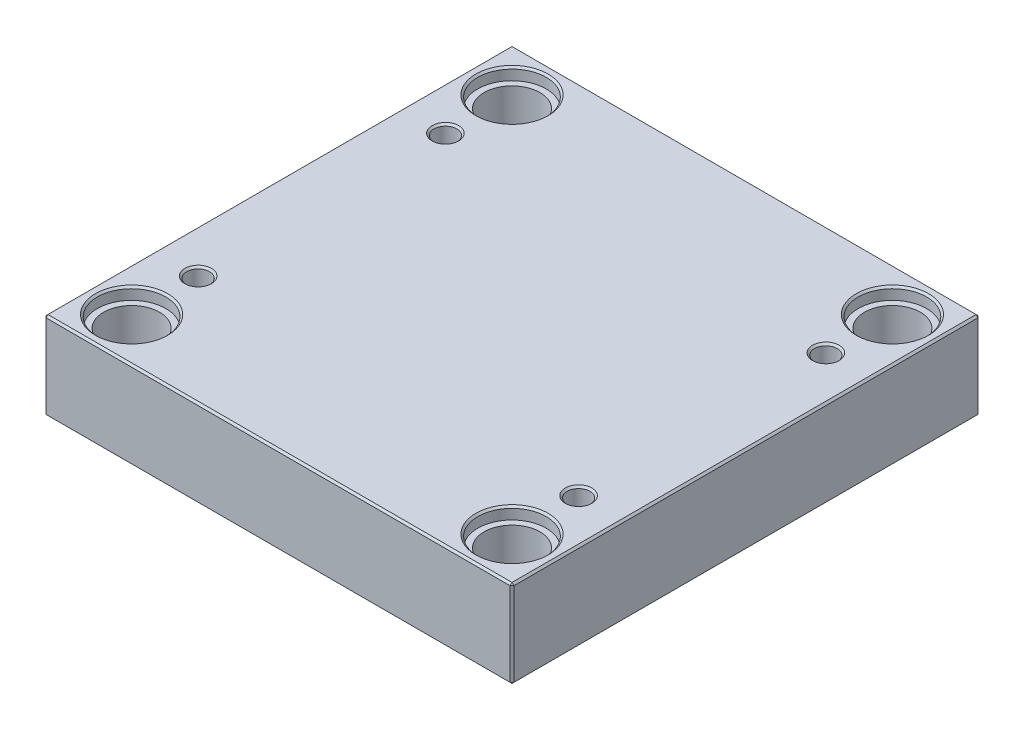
ISO-10303-21;
HEADER;
FILE_DESCRIPTION(('STEP AP214'),'2;1');
FILE_NAME('part.step','',(''),(''),'','','');
FILE_SCHEMA(('AUTOMOTIVE_DESIGN { 1 0 10303 214 1 1 1 1 }'));
ENDSEC;
DATA;
#1=APPLICATION_CONTEXT('core data for automotive mechanical design processes');
#2=APPLICATION_PROTOCOL_DEFINITION('international standard','automotive_design',2000,#1);
#3=PRODUCT_CONTEXT('',#1,'mechanical');
#4=PRODUCT('Part','Part','',(#3));
#5=PRODUCT_RELATED_PRODUCT_CATEGORY('part','',(#4));
#6=PRODUCT_DEFINITION_FORMATION('','',#4);
#7=PRODUCT_DEFINITION_CONTEXT('part definition',#1,'design');
#8=PRODUCT_DEFINITION('design','',#6,#7);
#9=PRODUCT_DEFINITION_SHAPE('','',#8);
#10=(LENGTH_UNIT() NAMED_UNIT(*) SI_UNIT(.MILLI.,.METRE.));
#11=(NAMED_UNIT(*) PLANE_ANGLE_UNIT() SI_UNIT($,.RADIAN.));
#12=(NAMED_UNIT(*) SI_UNIT($,.STERADIAN.) SOLID_ANGLE_UNIT());
#13=UNCERTAINTY_MEASURE_WITH_UNIT(LENGTH_MEASURE(1.E-05),#10,'distance_accuracy_value','');
#14=(GEOMETRIC_REPRESENTATION_CONTEXT(3) GLOBAL_UNCERTAINTY_ASSIGNED_CONTEXT((#13)) GLOBAL_UNIT_ASSIGNED_CONTEXT((#10,
#11,#12)) REPRESENTATION_CONTEXT('',''));
#15=CARTESIAN_POINT('',(0.,0.,0.));
#16=DIRECTION('',(0.,0.,1.));
#17=DIRECTION('',(1.,0.,0.));
#18=AXIS2_PLACEMENT_3D('',#15,#16,#17);
#19=CARTESIAN_POINT('',(-100.,0.,-100.));
#20=DIRECTION('',(0.,1.,0.));
#21=DIRECTION('',(0.,0.,1.));
#22=AXIS2_PLACEMENT_3D('',#19,#20,#21);
#23=CYLINDRICAL_SURFACE('',#22,14.7);
#24=CARTESIAN_POINT('',(-100.,1.00000000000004,-100.));
#25=DIRECTION('',(0.,1.,0.));
#26=DIRECTION('',(0.,0.,1.));
#27=AXIS2_PLACEMENT_3D('',#24,#25,#26);
#28=CIRCLE('',#27,14.7);
#29=CARTESIAN_POINT('',(-100.,1.00000000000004,-85.3));
#30=VERTEX_POINT('',#29);
#31=EDGE_CURVE('E472',#30,#30,#28,.F.);
#32=ORIENTED_EDGE('',*,*,#31,.T.);
#33=EDGE_LOOP('',(#32));
#34=FACE_BOUND('',#33,.T.);
#35=CARTESIAN_POINT('',(-100.,39.7,-100.));
#36=DIRECTION('',(0.,1.,0.));
#37=DIRECTION('',(0.,0.,1.));
#38=AXIS2_PLACEMENT_3D('',#35,#36,#37);
#39=CIRCLE('',#38,14.7);
#40=CARTESIAN_POINT('',(-100.,39.7,-85.3));
#41=VERTEX_POINT('',#40);
#42=EDGE_CURVE('E221',#41,#41,#39,.F.);
#43=ORIENTED_EDGE('',*,*,#42,.F.);
#44=EDGE_LOOP('',(#43));
#45=FACE_BOUND('',#44,.T.);
#46=ADVANCED_FACE('F16',(#34,#45),#23,.F.);
#47=CARTESIAN_POINT('',(100.,0.,-100.));
#48=DIRECTION('',(0.,1.,0.));
#49=DIRECTION('',(0.,0.,1.));
#50=AXIS2_PLACEMENT_3D('',#47,#48,#49);
#51=CYLINDRICAL_SURFACE('',#50,14.7);
#52=CARTESIAN_POINT('',(100.,1.00000000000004,-100.));
#53=DIRECTION('',(0.,1.,0.));
#54=DIRECTION('',(0.,0.,1.));
#55=AXIS2_PLACEMENT_3D('',#52,#53,#54);
#56=CIRCLE('',#55,14.7);
#57=CARTESIAN_POINT('',(100.,1.00000000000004,-85.3));
#58=VERTEX_POINT('',#57);
#59=EDGE_CURVE('E474',#58,#58,#56,.F.);
#60=ORIENTED_EDGE('',*,*,#59,.T.);
#61=EDGE_LOOP('',(#60));
#62=FACE_BOUND('',#61,.T.);
#63=CARTESIAN_POINT('',(100.,39.7,-100.));
#64=DIRECTION('',(0.,1.,0.));
#65=DIRECTION('',(0.,0.,1.));
#66=AXIS2_PLACEMENT_3D('',#63,#64,#65);
#67=CIRCLE('',#66,14.7);
#68=CARTESIAN_POINT('',(100.,39.7,-85.3));
#69=VERTEX_POINT('',#68);
#70=EDGE_CURVE('E218',#69,#69,#67,.F.);
#71=ORIENTED_EDGE('',*,*,#70,.F.);
#72=EDGE_LOOP('',(#71));
#73=FACE_BOUND('',#72,.T.);
#74=ADVANCED_FACE('F263',(#62,#73),#51,.F.);
#75=CARTESIAN_POINT('',(100.,0.,100.));
#76=DIRECTION('',(0.,1.,0.));
#77=DIRECTION('',(0.,0.,1.));
#78=AXIS2_PLACEMENT_3D('',#75,#76,#77);
#79=CYLINDRICAL_SURFACE('',#78,14.7);
#80=CARTESIAN_POINT('',(100.,1.00000000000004,100.));
#81=DIRECTION('',(0.,1.,0.));
#82=DIRECTION('',(0.,0.,1.));
#83=AXIS2_PLACEMENT_3D('',#80,#81,#82);
#84=CIRCLE('',#83,14.7);
#85=CARTESIAN_POINT('',(100.,1.00000000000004,114.7));
#86=VERTEX_POINT('',#85);
#87=EDGE_CURVE('E477',#86,#86,#84,.F.);
#88=ORIENTED_EDGE('',*,*,#87,.T.);
#89=EDGE_LOOP('',(#88));
#90=FACE_BOUND('',#89,.T.);
#91=CARTESIAN_POINT('',(100.,39.7,100.));
#92=DIRECTION('',(0.,1.,0.));
#93=DIRECTION('',(0.,0.,1.));
#94=AXIS2_PLACEMENT_3D('',#91,#92,#93);
#95=CIRCLE('',#94,14.7);
#96=CARTESIAN_POINT('',(100.,39.7,114.7));
#97=VERTEX_POINT('',#96);
#98=EDGE_CURVE('E214',#97,#97,#95,.F.);
#99=ORIENTED_EDGE('',*,*,#98,.F.);
#100=EDGE_LOOP('',(#99));
#101=FACE_BOUND('',#100,.T.);
#102=ADVANCED_FACE('F270',(#90,#101),#79,.F.);
#103=CARTESIAN_POINT('',(-100.,0.,100.));
#104=DIRECTION('',(0.,1.,0.));
#105=DIRECTION('',(0.,0.,1.));
#106=AXIS2_PLACEMENT_3D('',#103,#104,#105);
#107=CYLINDRICAL_SURFACE('',#106,14.7);
#108=CARTESIAN_POINT('',(-100.,1.00000000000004,100.));
#109=DIRECTION('',(0.,1.,0.));
#110=DIRECTION('',(0.,0.,1.));
#111=AXIS2_PLACEMENT_3D('',#108,#109,#110);
#112=CIRCLE('',#111,14.7);
#113=CARTESIAN_POINT('',(-100.,1.00000000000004,114.7));
#114=VERTEX_POINT('',#113);
#115=EDGE_CURVE('E480',#114,#114,#112,.F.);
#116=ORIENTED_EDGE('',*,*,#115,.T.);
#117=EDGE_LOOP('',(#116));
#118=FACE_BOUND('',#117,.T.);
#119=CARTESIAN_POINT('',(-100.,39.7,100.));
#120=DIRECTION('',(0.,1.,0.));
#121=DIRECTION('',(0.,0.,1.));
#122=AXIS2_PLACEMENT_3D('',#119,#120,#121);
#123=CIRCLE('',#122,14.7);
#124=CARTESIAN_POINT('',(-100.,39.7,114.7));
#125=VERTEX_POINT('',#124);
#126=EDGE_CURVE('E211',#125,#125,#123,.F.);
#127=ORIENTED_EDGE('',*,*,#126,.F.);
#128=EDGE_LOOP('',(#127));
#129=FACE_BOUND('',#128,.T.);
#130=ADVANCED_FACE('F277',(#118,#129),#107,.F.);
#131=CARTESIAN_POINT('',(-123.,46.,123.));
#132=DIRECTION('',(1.,0.,0.));
#133=DIRECTION('',(0.,0.,-1.));
#134=AXIS2_PLACEMENT_3D('',#131,#132,#133);
#135=PLANE('',#134);
#136=DIRECTION('',(0.,-1.,0.));
#137=VECTOR('',#136,1.);
#138=CARTESIAN_POINT('',(-123.,46.,-122.));
#139=LINE('',#138,#137);
#140=CARTESIAN_POINT('',(-123.,45.,-122.));
#141=VERTEX_POINT('',#140);
#142=CARTESIAN_POINT('',(-123.,0.999999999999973,-122.));
#143=VERTEX_POINT('',#142);
#144=EDGE_CURVE('E487',#141,#143,#139,.T.);
#145=ORIENTED_EDGE('',*,*,#144,.T.);
#146=DIRECTION('',(0.,0.,1.));
#147=VECTOR('',#146,1.);
#148=CARTESIAN_POINT('',(-123.,0.999999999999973,123.));
#149=LINE('',#148,#147);
#150=CARTESIAN_POINT('',(-123.,0.999999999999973,122.));
#151=VERTEX_POINT('',#150);
#152=EDGE_CURVE('E490',#143,#151,#149,.T.);
#153=ORIENTED_EDGE('',*,*,#152,.T.);
#154=DIRECTION('',(0.,1.,0.));
#155=VECTOR('',#154,1.);
#156=CARTESIAN_POINT('',(-123.,46.,122.));
#157=LINE('',#156,#155);
#158=CARTESIAN_POINT('',(-123.,45.,122.));
#159=VERTEX_POINT('',#158);
#160=EDGE_CURVE('E485',#151,#159,#157,.T.);
#161=ORIENTED_EDGE('',*,*,#160,.T.);
#162=DIRECTION('',(0.,0.,-1.));
#163=VECTOR('',#162,1.);
#164=CARTESIAN_POINT('',(-123.,45.,-123.));
#165=LINE('',#164,#163);
#166=EDGE_CURVE('E483',#159,#141,#165,.T.);
#167=ORIENTED_EDGE('',*,*,#166,.T.);
#168=EDGE_LOOP('',(#145,#153,#161,#167));
#169=FACE_BOUND('',#168,.T.);
#170=ADVANCED_FACE('F298',(#169),#135,.F.);
#171=CARTESIAN_POINT('',(123.,46.,123.));
#172=DIRECTION('',(0.,0.,-1.));
#173=DIRECTION('',(-1.,0.,0.));
#174=AXIS2_PLACEMENT_3D('',#171,#172,#173);
#175=PLANE('',#174);
#176=DIRECTION('',(-1.,0.,0.));
#177=VECTOR('',#176,1.);
#178=CARTESIAN_POINT('',(-123.,45.,123.));
#179=LINE('',#178,#177);
#180=CARTESIAN_POINT('',(122.,45.,123.));
#181=VERTEX_POINT('',#180);
#182=CARTESIAN_POINT('',(-122.,45.,123.));
#183=VERTEX_POINT('',#182);
#184=EDGE_CURVE('E509',#181,#183,#179,.T.);
#185=ORIENTED_EDGE('',*,*,#184,.T.);
#186=DIRECTION('',(0.,-1.,0.));
#187=VECTOR('',#186,1.);
#188=CARTESIAN_POINT('',(-122.,46.,123.));
#189=LINE('',#188,#187);
#190=CARTESIAN_POINT('',(-122.,0.999999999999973,123.));
#191=VERTEX_POINT('',#190);
#192=EDGE_CURVE('E515',#183,#191,#189,.T.);
#193=ORIENTED_EDGE('',*,*,#192,.T.);
#194=DIRECTION('',(1.,0.,0.));
#195=VECTOR('',#194,1.);
#196=CARTESIAN_POINT('',(123.,0.999999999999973,123.));
#197=LINE('',#196,#195);
#198=CARTESIAN_POINT('',(122.,0.999999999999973,123.));
#199=VERTEX_POINT('',#198);
#200=EDGE_CURVE('E513',#191,#199,#197,.T.);
#201=ORIENTED_EDGE('',*,*,#200,.T.);
#202=DIRECTION('',(0.,1.,0.));
#203=VECTOR('',#202,1.);
#204=CARTESIAN_POINT('',(122.,46.,123.));
#205=LINE('',#204,#203);
#206=EDGE_CURVE('E511',#199,#181,#205,.T.);
#207=ORIENTED_EDGE('',*,*,#206,.T.);
#208=EDGE_LOOP('',(#185,#193,#201,#207));
#209=FACE_BOUND('',#208,.T.);
#210=ADVANCED_FACE('F294',(#209),#175,.F.);
#211=CARTESIAN_POINT('',(123.,46.,123.));
#212=DIRECTION('',(-1.,0.,0.));
#213=DIRECTION('',(0.,0.,1.));
#214=AXIS2_PLACEMENT_3D('',#211,#212,#213);
#215=PLANE('',#214);
#216=DIRECTION('',(0.,0.,-1.));
#217=VECTOR('',#216,1.);
#218=CARTESIAN_POINT('',(123.,0.999999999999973,123.));
#219=LINE('',#218,#217);
#220=CARTESIAN_POINT('',(123.,0.999999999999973,122.));
#221=VERTEX_POINT('',#220);
#222=CARTESIAN_POINT('',(123.,0.999999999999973,-122.));
#223=VERTEX_POINT('',#222);
#224=EDGE_CURVE('E504',#221,#223,#219,.T.);
#225=ORIENTED_EDGE('',*,*,#224,.T.);
#226=DIRECTION('',(0.,1.,0.));
#227=VECTOR('',#226,1.);
#228=CARTESIAN_POINT('',(123.,46.,-122.));
#229=LINE('',#228,#227);
#230=CARTESIAN_POINT('',(123.,45.,-122.));
#231=VERTEX_POINT('',#230);
#232=EDGE_CURVE('E506',#223,#231,#229,.T.);
#233=ORIENTED_EDGE('',*,*,#232,.T.);
#234=DIRECTION('',(0.,0.,1.));
#235=VECTOR('',#234,1.);
#236=CARTESIAN_POINT('',(123.,45.,123.));
#237=LINE('',#236,#235);
#238=CARTESIAN_POINT('',(123.,45.,122.));
#239=VERTEX_POINT('',#238);
#240=EDGE_CURVE('E500',#231,#239,#237,.T.);
#241=ORIENTED_EDGE('',*,*,#240,.T.);
#242=DIRECTION('',(0.,-1.,0.));
#243=VECTOR('',#242,1.);
#244=CARTESIAN_POINT('',(123.,46.,122.));
#245=LINE('',#244,#243);
#246=EDGE_CURVE('E502',#239,#221,#245,.T.);
#247=ORIENTED_EDGE('',*,*,#246,.T.);
#248=EDGE_LOOP('',(#225,#233,#241,#247));
#249=FACE_BOUND('',#248,.T.);
#250=ADVANCED_FACE('F290',(#249),#215,.F.);
#251=CARTESIAN_POINT('',(123.,46.,-123.));
#252=DIRECTION('',(0.,0.,1.));
#253=DIRECTION('',(1.,0.,0.));
#254=AXIS2_PLACEMENT_3D('',#251,#252,#253);
#255=PLANE('',#254);
#256=DIRECTION('',(0.,-1.,0.));
#257=VECTOR('',#256,1.);
#258=CARTESIAN_POINT('',(122.,46.,-123.));
#259=LINE('',#258,#257);
#260=CARTESIAN_POINT('',(122.,45.,-123.));
#261=VERTEX_POINT('',#260);
#262=CARTESIAN_POINT('',(122.,0.999999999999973,-123.));
#263=VERTEX_POINT('',#262);
#264=EDGE_CURVE('E494',#261,#263,#259,.T.);
#265=ORIENTED_EDGE('',*,*,#264,.T.);
#266=DIRECTION('',(-1.,0.,0.));
#267=VECTOR('',#266,1.);
#268=CARTESIAN_POINT('',(123.,0.999999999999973,-123.));
#269=LINE('',#268,#267);
#270=CARTESIAN_POINT('',(-122.,0.999999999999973,-123.));
#271=VERTEX_POINT('',#270);
#272=EDGE_CURVE('E138',#263,#271,#269,.T.);
#273=ORIENTED_EDGE('',*,*,#272,.T.);
#274=DIRECTION('',(0.,1.,0.));
#275=VECTOR('',#274,1.);
#276=CARTESIAN_POINT('',(-122.,46.,-123.));
#277=LINE('',#276,#275);
#278=CARTESIAN_POINT('',(-122.,45.,-123.));
#279=VERTEX_POINT('',#278);
#280=EDGE_CURVE('E496',#271,#279,#277,.T.);
#281=ORIENTED_EDGE('',*,*,#280,.T.);
#282=DIRECTION('',(1.,0.,0.));
#283=VECTOR('',#282,1.);
#284=CARTESIAN_POINT('',(123.,45.,-123.));
#285=LINE('',#284,#283);
#286=EDGE_CURVE('E492',#279,#261,#285,.T.);
#287=ORIENTED_EDGE('',*,*,#286,.T.);
#288=EDGE_LOOP('',(#265,#273,#281,#287));
#289=FACE_BOUND('',#288,.T.);
#290=ADVANCED_FACE('F282',(#289),#255,.F.);
#291=CARTESIAN_POINT('',(0.,46.,0.));
#292=DIRECTION('',(0.,1.,0.));
#293=DIRECTION('',(0.,0.,1.));
#294=AXIS2_PLACEMENT_3D('',#291,#292,#293);
#295=PLANE('',#294);
#296=CARTESIAN_POINT('',(100.,46.,100.));
#297=DIRECTION('',(0.,1.,0.));
#298=DIRECTION('',(0.,0.,1.));
#299=AXIS2_PLACEMENT_3D('',#296,#297,#298);
#300=CIRCLE('',#299,19.);
#301=CARTESIAN_POINT('',(100.,46.,119.));
#302=VERTEX_POINT('',#301);
#303=EDGE_CURVE('E236',#302,#302,#300,.F.);
#304=ORIENTED_EDGE('',*,*,#303,.T.);
#305=EDGE_LOOP('',(#304));
#306=FACE_BOUND('',#305,.T.);
#307=CARTESIAN_POINT('',(-100.,46.,100.));
#308=DIRECTION('',(0.,1.,0.));
#309=DIRECTION('',(0.,0.,1.));
#310=AXIS2_PLACEMENT_3D('',#307,#308,#309);
#311=CIRCLE('',#310,19.);
#312=CARTESIAN_POINT('',(-100.,46.,119.));
#313=VERTEX_POINT('',#312);
#314=EDGE_CURVE('E233',#313,#313,#311,.F.);
#315=ORIENTED_EDGE('',*,*,#314,.T.);
#316=EDGE_LOOP('',(#315));
#317=FACE_BOUND('',#316,.T.);
#318=CARTESIAN_POINT('',(100.,46.,-100.));
#319=DIRECTION('',(0.,1.,0.));
#320=DIRECTION('',(0.,0.,1.));
#321=AXIS2_PLACEMENT_3D('',#318,#319,#320);
#322=CIRCLE('',#321,19.);
#323=CARTESIAN_POINT('',(100.,46.,-81.));
#324=VERTEX_POINT('',#323);
#325=EDGE_CURVE('E230',#324,#324,#322,.F.);
#326=ORIENTED_EDGE('',*,*,#325,.T.);
#327=EDGE_LOOP('',(#326));
#328=FACE_BOUND('',#327,.T.);
#329=CARTESIAN_POINT('',(-100.,46.,-100.));
#330=DIRECTION('',(0.,1.,0.));
#331=DIRECTION('',(0.,0.,1.));
#332=AXIS2_PLACEMENT_3D('',#329,#330,#331);
#333=CIRCLE('',#332,19.);
#334=CARTESIAN_POINT('',(-100.,46.,-81.));
#335=VERTEX_POINT('',#334);
#336=EDGE_CURVE('E227',#335,#335,#333,.F.);
#337=ORIENTED_EDGE('',*,*,#336,.T.);
#338=EDGE_LOOP('',(#337));
#339=FACE_BOUND('',#338,.T.);
#340=CARTESIAN_POINT('',(-100.,46.,65.));
#341=DIRECTION('',(0.,1.,0.));
#342=DIRECTION('',(0.,0.,1.));
#343=AXIS2_PLACEMENT_3D('',#340,#341,#342);
#344=CIRCLE('',#343,6.99999999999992);
#345=CARTESIAN_POINT('',(-100.,46.,71.9999999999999));
#346=VERTEX_POINT('',#345);
#347=EDGE_CURVE('E198',#346,#346,#344,.F.);
#348=ORIENTED_EDGE('',*,*,#347,.T.);
#349=EDGE_LOOP('',(#348));
#350=FACE_BOUND('',#349,.T.);
#351=CARTESIAN_POINT('',(100.,46.,65.));
#352=DIRECTION('',(0.,1.,0.));
#353=DIRECTION('',(0.,0.,1.));
#354=AXIS2_PLACEMENT_3D('',#351,#352,#353);
#355=CIRCLE('',#354,6.99999999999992);
#356=CARTESIAN_POINT('',(100.,46.,71.9999999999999));
#357=VERTEX_POINT('',#356);
#358=EDGE_CURVE('E195',#357,#357,#355,.F.);
#359=ORIENTED_EDGE('',*,*,#358,.T.);
#360=EDGE_LOOP('',(#359));
#361=FACE_BOUND('',#360,.T.);
#362=CARTESIAN_POINT('',(100.,46.,-65.));
#363=DIRECTION('',(0.,1.,0.));
#364=DIRECTION('',(0.,0.,1.));
#365=AXIS2_PLACEMENT_3D('',#362,#363,#364);
#366=CIRCLE('',#365,6.99999999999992);
#367=CARTESIAN_POINT('',(100.,46.,-58.0000000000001));
#368=VERTEX_POINT('',#367);
#369=EDGE_CURVE('E192',#368,#368,#366,.F.);
#370=ORIENTED_EDGE('',*,*,#369,.T.);
#371=EDGE_LOOP('',(#370));
#372=FACE_BOUND('',#371,.T.);
#373=CARTESIAN_POINT('',(-100.,46.,-65.));
#374=DIRECTION('',(0.,1.,0.));
#375=DIRECTION('',(0.,0.,1.));
#376=AXIS2_PLACEMENT_3D('',#373,#374,#375);
#377=CIRCLE('',#376,6.99999999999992);
#378=CARTESIAN_POINT('',(-100.,46.,-58.0000000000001));
#379=VERTEX_POINT('',#378);
#380=EDGE_CURVE('E188',#379,#379,#377,.F.);
#381=ORIENTED_EDGE('',*,*,#380,.T.);
#382=EDGE_LOOP('',(#381));
#383=FACE_BOUND('',#382,.T.);
#384=DIRECTION('',(0.,0.,-1.));
#385=VECTOR('',#384,1.);
#386=CARTESIAN_POINT('',(122.,46.,-123.));
#387=LINE('',#386,#385);
#388=CARTESIAN_POINT('',(122.,46.,122.));
#389=VERTEX_POINT('',#388);
#390=CARTESIAN_POINT('',(122.,46.,-122.));
#391=VERTEX_POINT('',#390);
#392=EDGE_CURVE('E31',#389,#391,#387,.T.);
#393=ORIENTED_EDGE('',*,*,#392,.T.);
#394=DIRECTION('',(-1.,0.,0.));
#395=VECTOR('',#394,1.);
#396=CARTESIAN_POINT('',(-123.,46.,-122.));
#397=LINE('',#396,#395);
#398=CARTESIAN_POINT('',(-122.,46.,-122.));
#399=VERTEX_POINT('',#398);
#400=EDGE_CURVE('E189',#391,#399,#397,.T.);
#401=ORIENTED_EDGE('',*,*,#400,.T.);
#402=DIRECTION('',(0.,0.,1.));
#403=VECTOR('',#402,1.);
#404=CARTESIAN_POINT('',(-122.,46.,123.));
#405=LINE('',#404,#403);
#406=CARTESIAN_POINT('',(-122.,46.,122.));
#407=VERTEX_POINT('',#406);
#408=EDGE_CURVE('E518',#399,#407,#405,.T.);
#409=ORIENTED_EDGE('',*,*,#408,.T.);
#410=DIRECTION('',(1.,0.,0.));
#411=VECTOR('',#410,1.);
#412=CARTESIAN_POINT('',(123.,46.,122.));
#413=LINE('',#412,#411);
#414=EDGE_CURVE('E36',#407,#389,#413,.T.);
#415=ORIENTED_EDGE('',*,*,#414,.T.);
#416=EDGE_LOOP('',(#393,#401,#409,#415));
#417=FACE_BOUND('',#416,.T.);
#418=ADVANCED_FACE('F279',(#306,#317,#328,#339,#350,#361,#372,#383,#417),#295,.T.);
#419=CARTESIAN_POINT('',(0.,0.,0.));
#420=DIRECTION('',(0.,1.,0.));
#421=DIRECTION('',(0.,0.,1.));
#422=AXIS2_PLACEMENT_3D('',#419,#420,#421);
#423=PLANE('',#422);
#424=CARTESIAN_POINT('',(-100.,0.,-100.));
#425=DIRECTION('',(0.,1.,0.));
#426=DIRECTION('',(0.,0.,1.));
#427=AXIS2_PLACEMENT_3D('',#424,#425,#426);
#428=CIRCLE('',#427,15.7);
#429=CARTESIAN_POINT('',(-100.,0.,-84.3));
#430=VERTEX_POINT('',#429);
#431=EDGE_CURVE('E469',#430,#430,#428,.T.);
#432=ORIENTED_EDGE('',*,*,#431,.T.);
#433=EDGE_LOOP('',(#432));
#434=FACE_BOUND('',#433,.T.);
#435=CARTESIAN_POINT('',(100.,0.,-100.));
#436=DIRECTION('',(0.,1.,0.));
#437=DIRECTION('',(0.,0.,1.));
#438=AXIS2_PLACEMENT_3D('',#435,#436,#437);
#439=CIRCLE('',#438,15.7);
#440=CARTESIAN_POINT('',(100.,0.,-84.3));
#441=VERTEX_POINT('',#440);
#442=EDGE_CURVE('E466',#441,#441,#439,.T.);
#443=ORIENTED_EDGE('',*,*,#442,.T.);
#444=EDGE_LOOP('',(#443));
#445=FACE_BOUND('',#444,.T.);
#446=CARTESIAN_POINT('',(100.,0.,100.));
#447=DIRECTION('',(0.,1.,0.));
#448=DIRECTION('',(0.,0.,1.));
#449=AXIS2_PLACEMENT_3D('',#446,#447,#448);
#450=CIRCLE('',#449,15.7);
#451=CARTESIAN_POINT('',(100.,0.,115.7));
#452=VERTEX_POINT('',#451);
#453=EDGE_CURVE('E463',#452,#452,#450,.T.);
#454=ORIENTED_EDGE('',*,*,#453,.T.);
#455=EDGE_LOOP('',(#454));
#456=FACE_BOUND('',#455,.T.);
#457=CARTESIAN_POINT('',(-100.,0.,100.));
#458=DIRECTION('',(0.,1.,0.));
#459=DIRECTION('',(0.,0.,1.));
#460=AXIS2_PLACEMENT_3D('',#457,#458,#459);
#461=CIRCLE('',#460,15.7);
#462=CARTESIAN_POINT('',(-100.,0.,115.7));
#463=VERTEX_POINT('',#462);
#464=EDGE_CURVE('E460',#463,#463,#461,.T.);
#465=ORIENTED_EDGE('',*,*,#464,.T.);
#466=EDGE_LOOP('',(#465));
#467=FACE_BOUND('',#466,.T.);
#468=DIRECTION('',(0.,0.,1.));
#469=VECTOR('',#468,1.);
#470=CARTESIAN_POINT('',(122.,0.,0.));
#471=LINE('',#470,#469);
#472=CARTESIAN_POINT('',(122.,0.,-122.));
#473=VERTEX_POINT('',#472);
#474=CARTESIAN_POINT('',(122.,0.,122.));
#475=VERTEX_POINT('',#474);
#476=EDGE_CURVE('E108',#473,#475,#471,.T.);
#477=ORIENTED_EDGE('',*,*,#476,.T.);
#478=DIRECTION('',(-1.,0.,0.));
#479=VECTOR('',#478,1.);
#480=CARTESIAN_POINT('',(0.,0.,122.));
#481=LINE('',#480,#479);
#482=CARTESIAN_POINT('',(-122.,0.,122.));
#483=VERTEX_POINT('',#482);
#484=EDGE_CURVE('E458',#475,#483,#481,.T.);
#485=ORIENTED_EDGE('',*,*,#484,.T.);
#486=DIRECTION('',(0.,0.,-1.));
#487=VECTOR('',#486,1.);
#488=CARTESIAN_POINT('',(-122.,0.,0.));
#489=LINE('',#488,#487);
#490=CARTESIAN_POINT('',(-122.,0.,-122.));
#491=VERTEX_POINT('',#490);
#492=EDGE_CURVE('E110',#483,#491,#489,.T.);
#493=ORIENTED_EDGE('',*,*,#492,.T.);
#494=DIRECTION('',(1.,0.,0.));
#495=VECTOR('',#494,1.);
#496=CARTESIAN_POINT('',(0.,0.,-122.));
#497=LINE('',#496,#495);
#498=EDGE_CURVE('E104',#491,#473,#497,.T.);
#499=ORIENTED_EDGE('',*,*,#498,.T.);
#500=EDGE_LOOP('',(#477,#485,#493,#499));
#501=FACE_BOUND('',#500,.T.);
#502=ADVANCED_FACE('F106',(#434,#445,#456,#467,#501),#423,.F.);
#503=CARTESIAN_POINT('',(-100.,0.,-100.));
#504=DIRECTION('',(0.,-1.,0.));
#505=DIRECTION('',(0.,0.,-1.));
#506=AXIS2_PLACEMENT_3D('',#503,#504,#505);
#507=CONICAL_SURFACE('',#506,15.7,0.785398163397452);
#508=ORIENTED_EDGE('',*,*,#31,.F.);
#509=EDGE_LOOP('',(#508));
#510=FACE_BOUND('',#509,.T.);
#511=ORIENTED_EDGE('',*,*,#431,.F.);
#512=EDGE_LOOP('',(#511));
#513=FACE_BOUND('',#512,.T.);
#514=ADVANCED_FACE('F286',(#510,#513),#507,.F.);
#515=CARTESIAN_POINT('',(100.,0.,-100.));
#516=DIRECTION('',(0.,-1.,0.));
#517=DIRECTION('',(0.,0.,-1.));
#518=AXIS2_PLACEMENT_3D('',#515,#516,#517);
#519=CONICAL_SURFACE('',#518,15.7,0.785398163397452);
#520=ORIENTED_EDGE('',*,*,#59,.F.);
#521=EDGE_LOOP('',(#520));
#522=FACE_BOUND('',#521,.T.);
#523=ORIENTED_EDGE('',*,*,#442,.F.);
#524=EDGE_LOOP('',(#523));
#525=FACE_BOUND('',#524,.T.);
#526=ADVANCED_FACE('F305',(#522,#525),#519,.F.);
#527=CARTESIAN_POINT('',(100.,0.,100.));
#528=DIRECTION('',(0.,-1.,0.));
#529=DIRECTION('',(0.,0.,-1.));
#530=AXIS2_PLACEMENT_3D('',#527,#528,#529);
#531=CONICAL_SURFACE('',#530,15.7,0.785398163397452);
#532=ORIENTED_EDGE('',*,*,#87,.F.);
#533=EDGE_LOOP('',(#532));
#534=FACE_BOUND('',#533,.T.);
#535=ORIENTED_EDGE('',*,*,#453,.F.);
#536=EDGE_LOOP('',(#535));
#537=FACE_BOUND('',#536,.T.);
#538=ADVANCED_FACE('F309',(#534,#537),#531,.F.);
#539=CARTESIAN_POINT('',(-100.,0.,100.));
#540=DIRECTION('',(0.,-1.,0.));
#541=DIRECTION('',(0.,0.,-1.));
#542=AXIS2_PLACEMENT_3D('',#539,#540,#541);
#543=CONICAL_SURFACE('',#542,15.7,0.785398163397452);
#544=ORIENTED_EDGE('',*,*,#115,.F.);
#545=EDGE_LOOP('',(#544));
#546=FACE_BOUND('',#545,.T.);
#547=ORIENTED_EDGE('',*,*,#464,.F.);
#548=EDGE_LOOP('',(#547));
#549=FACE_BOUND('',#548,.T.);
#550=ADVANCED_FACE('F313',(#546,#549),#543,.F.);
#551=CARTESIAN_POINT('',(123.,46.,122.));
#552=DIRECTION('',(-0.707106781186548,0.,-0.707106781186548));
#553=DIRECTION('',(0.,-1.,0.));
#554=AXIS2_PLACEMENT_3D('',#551,#552,#553);
#555=PLANE('',#554);
#556=DIRECTION('',(-0.707106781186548,0.,0.707106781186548));
#557=VECTOR('',#556,1.);
#558=CARTESIAN_POINT('',(122.,45.,123.));
#559=LINE('',#558,#557);
#560=EDGE_CURVE('E126',#181,#239,#559,.F.);
#561=ORIENTED_EDGE('',*,*,#560,.F.);
#562=ORIENTED_EDGE('',*,*,#206,.F.);
#563=DIRECTION('',(0.707106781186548,0.,-0.707106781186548));
#564=VECTOR('',#563,1.);
#565=CARTESIAN_POINT('',(122.,0.999999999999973,123.));
#566=LINE('',#565,#564);
#567=EDGE_CURVE('E180',#221,#199,#566,.F.);
#568=ORIENTED_EDGE('',*,*,#567,.F.);
#569=ORIENTED_EDGE('',*,*,#246,.F.);
#570=EDGE_LOOP('',(#561,#562,#568,#569));
#571=FACE_BOUND('',#570,.T.);
#572=ADVANCED_FACE('F317',(#571),#555,.F.);
#573=CARTESIAN_POINT('',(122.,45.,123.));
#574=DIRECTION('',(0.577350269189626,0.577350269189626,0.577350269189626));
#575=DIRECTION('',(0.707106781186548,0.,-0.707106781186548));
#576=AXIS2_PLACEMENT_3D('',#573,#574,#575);
#577=PLANE('',#576);
#578=DIRECTION('',(0.,-0.70710678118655,0.707106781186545));
#579=VECTOR('',#578,1.);
#580=CARTESIAN_POINT('',(122.,45.,123.));
#581=LINE('',#580,#579);
#582=EDGE_CURVE('E175',#181,#389,#581,.F.);
#583=ORIENTED_EDGE('',*,*,#582,.F.);
#584=ORIENTED_EDGE('',*,*,#560,.T.);
#585=DIRECTION('',(-0.707106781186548,0.707106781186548,0.));
#586=VECTOR('',#585,1.);
#587=CARTESIAN_POINT('',(122.5,45.5,122.));
#588=LINE('',#587,#586);
#589=EDGE_CURVE('E177',#389,#239,#588,.F.);
#590=ORIENTED_EDGE('',*,*,#589,.F.);
#591=EDGE_LOOP('',(#583,#584,#590));
#592=FACE_BOUND('',#591,.T.);
#593=ADVANCED_FACE('F385',(#592),#577,.T.);
#594=CARTESIAN_POINT('',(122.,0.999999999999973,123.));
#595=DIRECTION('',(0.577350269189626,-0.577350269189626,0.577350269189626));
#596=DIRECTION('',(0.707106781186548,0.,-0.707106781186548));
#597=AXIS2_PLACEMENT_3D('',#594,#595,#596);
#598=PLANE('',#597);
#599=DIRECTION('',(-0.707106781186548,-0.707106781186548,0.));
#600=VECTOR('',#599,1.);
#601=CARTESIAN_POINT('',(122.5,0.499999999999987,122.));
#602=LINE('',#601,#600);
#603=EDGE_CURVE('E124',#221,#475,#602,.T.);
#604=ORIENTED_EDGE('',*,*,#603,.F.);
#605=ORIENTED_EDGE('',*,*,#567,.T.);
#606=DIRECTION('',(0.,0.70710678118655,0.707106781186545));
#607=VECTOR('',#606,1.);
#608=CARTESIAN_POINT('',(122.,0.999999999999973,123.));
#609=LINE('',#608,#607);
#610=EDGE_CURVE('E172',#475,#199,#609,.T.);
#611=ORIENTED_EDGE('',*,*,#610,.F.);
#612=EDGE_LOOP('',(#604,#605,#611));
#613=FACE_BOUND('',#612,.T.);
#614=ADVANCED_FACE('F381',(#613),#598,.T.);
#615=CARTESIAN_POINT('',(122.,46.,0.));
#616=DIRECTION('',(0.707106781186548,0.707106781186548,0.));
#617=DIRECTION('',(0.,0.,1.));
#618=AXIS2_PLACEMENT_3D('',#615,#616,#617);
#619=PLANE('',#618);
#620=ORIENTED_EDGE('',*,*,#589,.T.);
#621=ORIENTED_EDGE('',*,*,#240,.F.);
#622=DIRECTION('',(0.707106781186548,-0.707106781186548,0.));
#623=VECTOR('',#622,1.);
#624=CARTESIAN_POINT('',(123.,45.,-122.));
#625=LINE('',#624,#623);
#626=EDGE_CURVE('E166',#391,#231,#625,.T.);
#627=ORIENTED_EDGE('',*,*,#626,.F.);
#628=ORIENTED_EDGE('',*,*,#392,.F.);
#629=EDGE_LOOP('',(#620,#621,#627,#628));
#630=FACE_BOUND('',#629,.T.);
#631=ADVANCED_FACE('F377',(#630),#619,.T.);
#632=CARTESIAN_POINT('',(0.,46.,122.));
#633=DIRECTION('',(0.,0.707106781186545,0.70710678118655));
#634=DIRECTION('',(-1.,0.,0.));
#635=AXIS2_PLACEMENT_3D('',#632,#633,#634);
#636=PLANE('',#635);
#637=ORIENTED_EDGE('',*,*,#582,.T.);
#638=ORIENTED_EDGE('',*,*,#414,.F.);
#639=DIRECTION('',(0.,0.70710678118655,-0.707106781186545));
#640=VECTOR('',#639,1.);
#641=CARTESIAN_POINT('',(-122.,45.5,122.5));
#642=LINE('',#641,#640);
#643=EDGE_CURVE('E163',#183,#407,#642,.T.);
#644=ORIENTED_EDGE('',*,*,#643,.F.);
#645=ORIENTED_EDGE('',*,*,#184,.F.);
#646=EDGE_LOOP('',(#637,#638,#644,#645));
#647=FACE_BOUND('',#646,.T.);
#648=ADVANCED_FACE('F373',(#647),#636,.T.);
#649=CARTESIAN_POINT('',(-122.,46.,123.));
#650=DIRECTION('',(0.707106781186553,0.,-0.707106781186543));
#651=DIRECTION('',(0.,-1.,0.));
#652=AXIS2_PLACEMENT_3D('',#649,#650,#651);
#653=PLANE('',#652);
#654=DIRECTION('',(0.707106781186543,0.,0.707106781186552));
#655=VECTOR('',#654,1.);
#656=CARTESIAN_POINT('',(-122.,0.999999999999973,123.));
#657=LINE('',#656,#655);
#658=EDGE_CURVE('E157',#191,#151,#657,.F.);
#659=ORIENTED_EDGE('',*,*,#658,.F.);
#660=ORIENTED_EDGE('',*,*,#192,.F.);
#661=DIRECTION('',(-0.707106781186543,0.,-0.707106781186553));
#662=VECTOR('',#661,1.);
#663=CARTESIAN_POINT('',(-123.,45.,122.));
#664=LINE('',#663,#662);
#665=EDGE_CURVE('E160',#159,#183,#664,.F.);
#666=ORIENTED_EDGE('',*,*,#665,.F.);
#667=ORIENTED_EDGE('',*,*,#160,.F.);
#668=EDGE_LOOP('',(#659,#660,#666,#667));
#669=FACE_BOUND('',#668,.T.);
#670=ADVANCED_FACE('F369',(#669),#653,.F.);
#671=CARTESIAN_POINT('',(123.,0.999999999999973,123.));
#672=DIRECTION('',(0.,0.707106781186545,-0.70710678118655));
#673=DIRECTION('',(1.,0.,0.));
#674=AXIS2_PLACEMENT_3D('',#671,#672,#673);
#675=PLANE('',#674);
#676=ORIENTED_EDGE('',*,*,#610,.T.);
#677=ORIENTED_EDGE('',*,*,#200,.F.);
#678=DIRECTION('',(0.,-0.70710678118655,-0.707106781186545));
#679=VECTOR('',#678,1.);
#680=CARTESIAN_POINT('',(-122.,0.999999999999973,123.));
#681=LINE('',#680,#679);
#682=EDGE_CURVE('E135',#483,#191,#681,.F.);
#683=ORIENTED_EDGE('',*,*,#682,.F.);
#684=ORIENTED_EDGE('',*,*,#484,.F.);
#685=EDGE_LOOP('',(#676,#677,#683,#684));
#686=FACE_BOUND('',#685,.T.);
#687=ADVANCED_FACE('F366',(#686),#675,.F.);
#688=CARTESIAN_POINT('',(123.,0.999999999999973,123.));
#689=DIRECTION('',(-0.707106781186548,0.707106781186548,0.));
#690=DIRECTION('',(0.,0.,-1.));
#691=AXIS2_PLACEMENT_3D('',#688,#689,#690);
#692=PLANE('',#691);
#693=ORIENTED_EDGE('',*,*,#603,.T.);
#694=ORIENTED_EDGE('',*,*,#476,.F.);
#695=DIRECTION('',(0.707106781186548,0.707106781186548,0.));
#696=VECTOR('',#695,1.);
#697=CARTESIAN_POINT('',(122.5,0.49999999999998,-122.));
#698=LINE('',#697,#696);
#699=EDGE_CURVE('E121',#223,#473,#698,.F.);
#700=ORIENTED_EDGE('',*,*,#699,.F.);
#701=ORIENTED_EDGE('',*,*,#224,.F.);
#702=EDGE_LOOP('',(#693,#694,#700,#701));
#703=FACE_BOUND('',#702,.T.);
#704=ADVANCED_FACE('F119',(#703),#692,.F.);
#705=CARTESIAN_POINT('',(122.,46.,-123.));
#706=DIRECTION('',(-0.707106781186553,0.,0.707106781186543));
#707=DIRECTION('',(0.,-1.,0.));
#708=AXIS2_PLACEMENT_3D('',#705,#706,#707);
#709=PLANE('',#708);
#710=DIRECTION('',(0.707106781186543,0.,0.707106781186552));
#711=VECTOR('',#710,1.);
#712=CARTESIAN_POINT('',(123.,45.,-122.));
#713=LINE('',#712,#711);
#714=EDGE_CURVE('E168',#231,#261,#713,.F.);
#715=ORIENTED_EDGE('',*,*,#714,.F.);
#716=ORIENTED_EDGE('',*,*,#232,.F.);
#717=DIRECTION('',(-0.707106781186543,0.,-0.707106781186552));
#718=VECTOR('',#717,1.);
#719=CARTESIAN_POINT('',(122.,0.999999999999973,-123.));
#720=LINE('',#719,#718);
#721=EDGE_CURVE('E134',#263,#223,#720,.F.);
#722=ORIENTED_EDGE('',*,*,#721,.F.);
#723=ORIENTED_EDGE('',*,*,#264,.F.);
#724=EDGE_LOOP('',(#715,#716,#722,#723));
#725=FACE_BOUND('',#724,.T.);
#726=ADVANCED_FACE('F359',(#725),#709,.F.);
#727=CARTESIAN_POINT('',(123.,45.,-122.));
#728=DIRECTION('',(0.577350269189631,0.577350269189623,-0.577350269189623));
#729=DIRECTION('',(-0.707106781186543,0.,-0.707106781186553));
#730=AXIS2_PLACEMENT_3D('',#727,#728,#729);
#731=PLANE('',#730);
#732=ORIENTED_EDGE('',*,*,#626,.T.);
#733=ORIENTED_EDGE('',*,*,#714,.T.);
#734=DIRECTION('',(0.,0.707106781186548,0.707106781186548));
#735=VECTOR('',#734,1.);
#736=CARTESIAN_POINT('',(122.,45.5,-122.5));
#737=LINE('',#736,#735);
#738=EDGE_CURVE('E152',#391,#261,#737,.F.);
#739=ORIENTED_EDGE('',*,*,#738,.F.);
#740=EDGE_LOOP('',(#732,#733,#739));
#741=FACE_BOUND('',#740,.T.);
#742=ADVANCED_FACE('F355',(#741),#731,.T.);
#743=CARTESIAN_POINT('',(-123.,45.,122.));
#744=DIRECTION('',(-0.577350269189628,0.577350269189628,0.577350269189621));
#745=DIRECTION('',(-0.707106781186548,-0.707106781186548,0.));
#746=AXIS2_PLACEMENT_3D('',#743,#744,#745);
#747=PLANE('',#746);
#748=ORIENTED_EDGE('',*,*,#665,.T.);
#749=ORIENTED_EDGE('',*,*,#643,.T.);
#750=DIRECTION('',(-0.707106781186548,-0.707106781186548,0.));
#751=VECTOR('',#750,1.);
#752=CARTESIAN_POINT('',(-123.,45.,122.));
#753=LINE('',#752,#751);
#754=EDGE_CURVE('E143',#159,#407,#753,.F.);
#755=ORIENTED_EDGE('',*,*,#754,.F.);
#756=EDGE_LOOP('',(#748,#749,#755));
#757=FACE_BOUND('',#756,.T.);
#758=ADVANCED_FACE('F351',(#757),#747,.T.);
#759=CARTESIAN_POINT('',(-122.,0.999999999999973,123.));
#760=DIRECTION('',(-0.577350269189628,-0.577350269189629,0.57735026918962));
#761=DIRECTION('',(0.707106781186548,-0.707106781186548,0.));
#762=AXIS2_PLACEMENT_3D('',#759,#760,#761);
#763=PLANE('',#762);
#764=ORIENTED_EDGE('',*,*,#682,.T.);
#765=ORIENTED_EDGE('',*,*,#658,.T.);
#766=DIRECTION('',(-0.707106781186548,0.707106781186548,0.));
#767=VECTOR('',#766,1.);
#768=CARTESIAN_POINT('',(-122.5,0.499999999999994,122.));
#769=LINE('',#768,#767);
#770=EDGE_CURVE('E139',#483,#151,#769,.T.);
#771=ORIENTED_EDGE('',*,*,#770,.F.);
#772=EDGE_LOOP('',(#764,#765,#771));
#773=FACE_BOUND('',#772,.T.);
#774=ADVANCED_FACE('F348',(#773),#763,.T.);
#775=CARTESIAN_POINT('',(122.,0.999999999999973,-123.));
#776=DIRECTION('',(0.577350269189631,-0.577350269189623,-0.577350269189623));
#777=DIRECTION('',(-0.707106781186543,0.,-0.707106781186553));
#778=AXIS2_PLACEMENT_3D('',#775,#776,#777);
#779=PLANE('',#778);
#780=ORIENTED_EDGE('',*,*,#721,.T.);
#781=ORIENTED_EDGE('',*,*,#699,.T.);
#782=DIRECTION('',(0.,-0.707106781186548,0.707106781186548));
#783=VECTOR('',#782,1.);
#784=CARTESIAN_POINT('',(122.,0.999999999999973,-123.));
#785=LINE('',#784,#783);
#786=EDGE_CURVE('E131',#263,#473,#785,.T.);
#787=ORIENTED_EDGE('',*,*,#786,.F.);
#788=EDGE_LOOP('',(#780,#781,#787));
#789=FACE_BOUND('',#788,.T.);
#790=ADVANCED_FACE('F130',(#789),#779,.T.);
#791=CARTESIAN_POINT('',(0.,46.,-122.));
#792=DIRECTION('',(0.,0.707106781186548,-0.707106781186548));
#793=DIRECTION('',(1.,0.,0.));
#794=AXIS2_PLACEMENT_3D('',#791,#792,#793);
#795=PLANE('',#794);
#796=ORIENTED_EDGE('',*,*,#738,.T.);
#797=ORIENTED_EDGE('',*,*,#286,.F.);
#798=DIRECTION('',(0.,-0.707106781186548,-0.707106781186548));
#799=VECTOR('',#798,1.);
#800=CARTESIAN_POINT('',(-122.,45.,-123.));
#801=LINE('',#800,#799);
#802=EDGE_CURVE('E140',#399,#279,#801,.T.);
#803=ORIENTED_EDGE('',*,*,#802,.F.);
#804=ORIENTED_EDGE('',*,*,#400,.F.);
#805=EDGE_LOOP('',(#796,#797,#803,#804));
#806=FACE_BOUND('',#805,.T.);
#807=ADVANCED_FACE('F341',(#806),#795,.T.);
#808=CARTESIAN_POINT('',(-122.,46.,0.));
#809=DIRECTION('',(-0.707106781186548,0.707106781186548,0.));
#810=DIRECTION('',(0.,0.,-1.));
#811=AXIS2_PLACEMENT_3D('',#808,#809,#810);
#812=PLANE('',#811);
#813=ORIENTED_EDGE('',*,*,#754,.T.);
#814=ORIENTED_EDGE('',*,*,#408,.F.);
#815=DIRECTION('',(0.707106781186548,0.707106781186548,0.));
#816=VECTOR('',#815,1.);
#817=CARTESIAN_POINT('',(-122.5,45.5,-122.));
#818=LINE('',#817,#816);
#819=EDGE_CURVE('E146',#141,#399,#818,.T.);
#820=ORIENTED_EDGE('',*,*,#819,.F.);
#821=ORIENTED_EDGE('',*,*,#166,.F.);
#822=EDGE_LOOP('',(#813,#814,#820,#821));
#823=FACE_BOUND('',#822,.T.);
#824=ADVANCED_FACE('F337',(#823),#812,.T.);
#825=CARTESIAN_POINT('',(-123.,0.999999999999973,123.));
#826=DIRECTION('',(0.707106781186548,0.707106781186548,0.));
#827=DIRECTION('',(0.,0.,1.));
#828=AXIS2_PLACEMENT_3D('',#825,#826,#827);
#829=PLANE('',#828);
#830=ORIENTED_EDGE('',*,*,#770,.T.);
#831=ORIENTED_EDGE('',*,*,#152,.F.);
#832=DIRECTION('',(0.707106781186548,-0.707106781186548,0.));
#833=VECTOR('',#832,1.);
#834=CARTESIAN_POINT('',(-123.,0.999999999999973,-122.));
#835=LINE('',#834,#833);
#836=EDGE_CURVE('E529',#491,#143,#835,.F.);
#837=ORIENTED_EDGE('',*,*,#836,.F.);
#838=ORIENTED_EDGE('',*,*,#492,.F.);
#839=EDGE_LOOP('',(#830,#831,#837,#838));
#840=FACE_BOUND('',#839,.T.);
#841=ADVANCED_FACE('F334',(#840),#829,.F.);
#842=CARTESIAN_POINT('',(123.,0.999999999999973,-123.));
#843=DIRECTION('',(0.,0.707106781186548,0.707106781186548));
#844=DIRECTION('',(-1.,0.,0.));
#845=AXIS2_PLACEMENT_3D('',#842,#843,#844);
#846=PLANE('',#845);
#847=ORIENTED_EDGE('',*,*,#786,.T.);
#848=ORIENTED_EDGE('',*,*,#498,.F.);
#849=DIRECTION('',(0.,0.707106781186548,-0.707106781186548));
#850=VECTOR('',#849,1.);
#851=CARTESIAN_POINT('',(-122.,0.499999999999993,-122.5));
#852=LINE('',#851,#850);
#853=EDGE_CURVE('E526',#271,#491,#852,.F.);
#854=ORIENTED_EDGE('',*,*,#853,.F.);
#855=ORIENTED_EDGE('',*,*,#272,.F.);
#856=EDGE_LOOP('',(#847,#848,#854,#855));
#857=FACE_BOUND('',#856,.T.);
#858=ADVANCED_FACE('F137',(#857),#846,.F.);
#859=CARTESIAN_POINT('',(-122.,45.,-123.));
#860=DIRECTION('',(-0.577350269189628,0.577350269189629,-0.57735026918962));
#861=DIRECTION('',(-0.707106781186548,-0.707106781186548,0.));
#862=AXIS2_PLACEMENT_3D('',#859,#860,#861);
#863=PLANE('',#862);
#864=ORIENTED_EDGE('',*,*,#819,.T.);
#865=ORIENTED_EDGE('',*,*,#802,.T.);
#866=DIRECTION('',(0.707106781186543,0.,-0.707106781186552));
#867=VECTOR('',#866,1.);
#868=CARTESIAN_POINT('',(-122.,45.,-123.));
#869=LINE('',#868,#867);
#870=EDGE_CURVE('E524',#141,#279,#869,.T.);
#871=ORIENTED_EDGE('',*,*,#870,.F.);
#872=EDGE_LOOP('',(#864,#865,#871));
#873=FACE_BOUND('',#872,.T.);
#874=ADVANCED_FACE('F327',(#873),#863,.T.);
#875=CARTESIAN_POINT('',(-123.,0.999999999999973,-122.));
#876=DIRECTION('',(-0.577350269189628,-0.577350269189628,-0.577350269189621));
#877=DIRECTION('',(0.707106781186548,-0.707106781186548,0.));
#878=AXIS2_PLACEMENT_3D('',#875,#876,#877);
#879=PLANE('',#878);
#880=ORIENTED_EDGE('',*,*,#853,.T.);
#881=ORIENTED_EDGE('',*,*,#836,.T.);
#882=DIRECTION('',(-0.707106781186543,0.,0.707106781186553));
#883=VECTOR('',#882,1.);
#884=CARTESIAN_POINT('',(-123.,0.999999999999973,-122.));
#885=LINE('',#884,#883);
#886=EDGE_CURVE('E455',#271,#143,#885,.T.);
#887=ORIENTED_EDGE('',*,*,#886,.F.);
#888=EDGE_LOOP('',(#880,#881,#887));
#889=FACE_BOUND('',#888,.T.);
#890=ADVANCED_FACE('F323',(#889),#879,.T.);
#891=CARTESIAN_POINT('',(-123.,46.,-122.));
#892=DIRECTION('',(0.707106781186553,0.,0.707106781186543));
#893=DIRECTION('',(0.,-1.,0.));
#894=AXIS2_PLACEMENT_3D('',#891,#892,#893);
#895=PLANE('',#894);
#896=ORIENTED_EDGE('',*,*,#870,.T.);
#897=ORIENTED_EDGE('',*,*,#280,.F.);
#898=ORIENTED_EDGE('',*,*,#886,.T.);
#899=ORIENTED_EDGE('',*,*,#144,.F.);
#900=EDGE_LOOP('',(#896,#897,#898,#899));
#901=FACE_BOUND('',#900,.T.);
#902=ADVANCED_FACE('F319',(#901),#895,.F.);
#903=CARTESIAN_POINT('',(-100.,22.,-65.));
#904=DIRECTION('',(0.,1.,0.));
#905=DIRECTION('',(0.,0.,1.));
#906=AXIS2_PLACEMENT_3D('',#903,#904,#905);
#907=CYLINDRICAL_SURFACE('',#906,6.);
#908=CARTESIAN_POINT('',(-100.,45.,-65.));
#909=DIRECTION('',(0.,1.,0.));
#910=DIRECTION('',(0.,0.,1.));
#911=AXIS2_PLACEMENT_3D('',#908,#909,#910);
#912=CIRCLE('',#911,6.);
#913=CARTESIAN_POINT('',(-100.,45.,-59.));
#914=VERTEX_POINT('',#913);
#915=EDGE_CURVE('E207',#914,#914,#912,.T.);
#916=ORIENTED_EDGE('',*,*,#915,.T.);
#917=EDGE_LOOP('',(#916));
#918=FACE_BOUND('',#917,.T.);
#919=CARTESIAN_POINT('',(-100.,22.,-65.));
#920=DIRECTION('',(0.,1.,0.));
#921=DIRECTION('',(0.,0.,1.));
#922=AXIS2_PLACEMENT_3D('',#919,#920,#921);
#923=CIRCLE('',#922,6.);
#924=CARTESIAN_POINT('',(-100.,22.,-59.));
#925=VERTEX_POINT('',#924);
#926=EDGE_CURVE('E448',#925,#925,#923,.T.);
#927=ORIENTED_EDGE('',*,*,#926,.F.);
#928=EDGE_LOOP('',(#927));
#929=FACE_BOUND('',#928,.T.);
#930=ADVANCED_FACE('F322',(#918,#929),#907,.F.);
#931=CARTESIAN_POINT('',(-100.,22.,-65.));
#932=DIRECTION('',(0.,1.,0.));
#933=DIRECTION('',(0.,0.,1.));
#934=AXIS2_PLACEMENT_3D('',#931,#932,#933);
#935=PLANE('',#934);
#936=ORIENTED_EDGE('',*,*,#926,.T.);
#937=EDGE_LOOP('',(#936));
#938=FACE_BOUND('',#937,.T.);
#939=ADVANCED_FACE('F596',(#938),#935,.T.);
#940=CARTESIAN_POINT('',(100.,22.,-65.));
#941=DIRECTION('',(0.,1.,0.));
#942=DIRECTION('',(0.,0.,1.));
#943=AXIS2_PLACEMENT_3D('',#940,#941,#942);
#944=CYLINDRICAL_SURFACE('',#943,6.);
#945=CARTESIAN_POINT('',(100.,45.,-65.));
#946=DIRECTION('',(0.,1.,0.));
#947=DIRECTION('',(0.,0.,1.));
#948=AXIS2_PLACEMENT_3D('',#945,#946,#947);
#949=CIRCLE('',#948,6.);
#950=CARTESIAN_POINT('',(100.,45.,-59.));
#951=VERTEX_POINT('',#950);
#952=EDGE_CURVE('E204',#951,#951,#949,.T.);
#953=ORIENTED_EDGE('',*,*,#952,.T.);
#954=EDGE_LOOP('',(#953));
#955=FACE_BOUND('',#954,.T.);
#956=CARTESIAN_POINT('',(100.,22.,-65.));
#957=DIRECTION('',(0.,1.,0.));
#958=DIRECTION('',(0.,0.,1.));
#959=AXIS2_PLACEMENT_3D('',#956,#957,#958);
#960=CIRCLE('',#959,6.);
#961=CARTESIAN_POINT('',(100.,22.,-59.));
#962=VERTEX_POINT('',#961);
#963=EDGE_CURVE('E445',#962,#962,#960,.T.);
#964=ORIENTED_EDGE('',*,*,#963,.F.);
#965=EDGE_LOOP('',(#964));
#966=FACE_BOUND('',#965,.T.);
#967=ADVANCED_FACE('F592',(#955,#966),#944,.F.);
#968=CARTESIAN_POINT('',(100.,22.,-65.));
#969=DIRECTION('',(0.,1.,0.));
#970=DIRECTION('',(0.,0.,1.));
#971=AXIS2_PLACEMENT_3D('',#968,#969,#970);
#972=PLANE('',#971);
#973=ORIENTED_EDGE('',*,*,#963,.T.);
#974=EDGE_LOOP('',(#973));
#975=FACE_BOUND('',#974,.T.);
#976=ADVANCED_FACE('F588',(#975),#972,.T.);
#977=CARTESIAN_POINT('',(100.,22.,65.));
#978=DIRECTION('',(0.,1.,0.));
#979=DIRECTION('',(0.,0.,1.));
#980=AXIS2_PLACEMENT_3D('',#977,#978,#979);
#981=CYLINDRICAL_SURFACE('',#980,6.);
#982=CARTESIAN_POINT('',(100.,45.,65.));
#983=DIRECTION('',(0.,1.,0.));
#984=DIRECTION('',(0.,0.,1.));
#985=AXIS2_PLACEMENT_3D('',#982,#983,#984);
#986=CIRCLE('',#985,6.);
#987=CARTESIAN_POINT('',(100.,45.,71.));
#988=VERTEX_POINT('',#987);
#989=EDGE_CURVE('E201',#988,#988,#986,.T.);
#990=ORIENTED_EDGE('',*,*,#989,.T.);
#991=EDGE_LOOP('',(#990));
#992=FACE_BOUND('',#991,.T.);
#993=CARTESIAN_POINT('',(100.,22.,65.));
#994=DIRECTION('',(0.,1.,0.));
#995=DIRECTION('',(0.,0.,1.));
#996=AXIS2_PLACEMENT_3D('',#993,#994,#995);
#997=CIRCLE('',#996,6.);
#998=CARTESIAN_POINT('',(100.,22.,71.));
#999=VERTEX_POINT('',#998);
#1000=EDGE_CURVE('E449',#999,#999,#997,.T.);
#1001=ORIENTED_EDGE('',*,*,#1000,.F.);
#1002=EDGE_LOOP('',(#1001));
#1003=FACE_BOUND('',#1002,.T.);
#1004=ADVANCED_FACE('F591',(#992,#1003),#981,.F.);
#1005=CARTESIAN_POINT('',(100.,22.,65.));
#1006=DIRECTION('',(0.,1.,0.));
#1007=DIRECTION('',(0.,0.,1.));
#1008=AXIS2_PLACEMENT_3D('',#1005,#1006,#1007);
#1009=PLANE('',#1008);
#1010=ORIENTED_EDGE('',*,*,#1000,.T.);
#1011=EDGE_LOOP('',(#1010));
#1012=FACE_BOUND('',#1011,.T.);
#1013=ADVANCED_FACE('F598',(#1012),#1009,.T.);
#1014=CARTESIAN_POINT('',(-100.,22.,65.));
#1015=DIRECTION('',(0.,1.,0.));
#1016=DIRECTION('',(0.,0.,1.));
#1017=AXIS2_PLACEMENT_3D('',#1014,#1015,#1016);
#1018=CYLINDRICAL_SURFACE('',#1017,6.);
#1019=CARTESIAN_POINT('',(-100.,45.,65.));
#1020=DIRECTION('',(0.,1.,0.));
#1021=DIRECTION('',(0.,0.,1.));
#1022=AXIS2_PLACEMENT_3D('',#1019,#1020,#1021);
#1023=CIRCLE('',#1022,6.);
#1024=CARTESIAN_POINT('',(-100.,45.,71.));
#1025=VERTEX_POINT('',#1024);
#1026=EDGE_CURVE('E185',#1025,#1025,#1023,.T.);
#1027=ORIENTED_EDGE('',*,*,#1026,.T.);
#1028=EDGE_LOOP('',(#1027));
#1029=FACE_BOUND('',#1028,.T.);
#1030=CARTESIAN_POINT('',(-100.,22.,65.));
#1031=DIRECTION('',(0.,1.,0.));
#1032=DIRECTION('',(0.,0.,1.));
#1033=AXIS2_PLACEMENT_3D('',#1030,#1031,#1032);
#1034=CIRCLE('',#1033,6.);
#1035=CARTESIAN_POINT('',(-100.,22.,71.));
#1036=VERTEX_POINT('',#1035);
#1037=EDGE_CURVE('E224',#1036,#1036,#1034,.T.);
#1038=ORIENTED_EDGE('',*,*,#1037,.F.);
#1039=EDGE_LOOP('',(#1038));
#1040=FACE_BOUND('',#1039,.T.);
#1041=ADVANCED_FACE('F601',(#1029,#1040),#1018,.F.);
#1042=CARTESIAN_POINT('',(-100.,22.,65.));
#1043=DIRECTION('',(0.,1.,0.));
#1044=DIRECTION('',(0.,0.,1.));
#1045=AXIS2_PLACEMENT_3D('',#1042,#1043,#1044);
#1046=PLANE('',#1045);
#1047=ORIENTED_EDGE('',*,*,#1037,.T.);
#1048=EDGE_LOOP('',(#1047));
#1049=FACE_BOUND('',#1048,.T.);
#1050=ADVANCED_FACE('F397',(#1049),#1046,.T.);
#1051=CARTESIAN_POINT('',(-100.,45.,65.));
#1052=DIRECTION('',(0.,1.,0.));
#1053=DIRECTION('',(0.,0.,1.));
#1054=AXIS2_PLACEMENT_3D('',#1051,#1052,#1053);
#1055=CONICAL_SURFACE('',#1054,6.,0.785398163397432);
#1056=ORIENTED_EDGE('',*,*,#347,.F.);
#1057=EDGE_LOOP('',(#1056));
#1058=FACE_BOUND('',#1057,.T.);
#1059=ORIENTED_EDGE('',*,*,#1026,.F.);
#1060=EDGE_LOOP('',(#1059));
#1061=FACE_BOUND('',#1060,.T.);
#1062=ADVANCED_FACE('F393',(#1058,#1061),#1055,.F.);
#1063=CARTESIAN_POINT('',(100.,45.,65.));
#1064=DIRECTION('',(0.,1.,0.));
#1065=DIRECTION('',(0.,0.,1.));
#1066=AXIS2_PLACEMENT_3D('',#1063,#1064,#1065);
#1067=CONICAL_SURFACE('',#1066,6.,0.785398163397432);
#1068=ORIENTED_EDGE('',*,*,#358,.F.);
#1069=EDGE_LOOP('',(#1068));
#1070=FACE_BOUND('',#1069,.T.);
#1071=ORIENTED_EDGE('',*,*,#989,.F.);
#1072=EDGE_LOOP('',(#1071));
#1073=FACE_BOUND('',#1072,.T.);
#1074=ADVANCED_FACE('F396',(#1070,#1073),#1067,.F.);
#1075=CARTESIAN_POINT('',(100.,45.,-65.));
#1076=DIRECTION('',(0.,1.,0.));
#1077=DIRECTION('',(0.,0.,1.));
#1078=AXIS2_PLACEMENT_3D('',#1075,#1076,#1077);
#1079=CONICAL_SURFACE('',#1078,6.,0.785398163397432);
#1080=ORIENTED_EDGE('',*,*,#369,.F.);
#1081=EDGE_LOOP('',(#1080));
#1082=FACE_BOUND('',#1081,.T.);
#1083=ORIENTED_EDGE('',*,*,#952,.F.);
#1084=EDGE_LOOP('',(#1083));
#1085=FACE_BOUND('',#1084,.T.);
#1086=ADVANCED_FACE('F401',(#1082,#1085),#1079,.F.);
#1087=CARTESIAN_POINT('',(-100.,45.,-65.));
#1088=DIRECTION('',(0.,1.,0.));
#1089=DIRECTION('',(0.,0.,1.));
#1090=AXIS2_PLACEMENT_3D('',#1087,#1088,#1089);
#1091=CONICAL_SURFACE('',#1090,6.,0.785398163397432);
#1092=ORIENTED_EDGE('',*,*,#380,.F.);
#1093=EDGE_LOOP('',(#1092));
#1094=FACE_BOUND('',#1093,.T.);
#1095=ORIENTED_EDGE('',*,*,#915,.F.);
#1096=EDGE_LOOP('',(#1095));
#1097=FACE_BOUND('',#1096,.T.);
#1098=ADVANCED_FACE('F405',(#1094,#1097),#1091,.F.);
#1099=CARTESIAN_POINT('',(-100.,39.7,100.));
#1100=DIRECTION('',(0.,1.,0.));
#1101=DIRECTION('',(0.,0.,1.));
#1102=AXIS2_PLACEMENT_3D('',#1099,#1100,#1101);
#1103=PLANE('',#1102);
#1104=CARTESIAN_POINT('',(-100.,39.7,100.));
#1105=DIRECTION('',(0.,1.,0.));
#1106=DIRECTION('',(0.,0.,1.));
#1107=AXIS2_PLACEMENT_3D('',#1104,#1105,#1106);
#1108=CIRCLE('',#1107,18.);
#1109=CARTESIAN_POINT('',(-100.,39.7,118.));
#1110=VERTEX_POINT('',#1109);
#1111=EDGE_CURVE('E436',#1110,#1110,#1108,.T.);
#1112=ORIENTED_EDGE('',*,*,#1111,.T.);
#1113=EDGE_LOOP('',(#1112));
#1114=FACE_BOUND('',#1113,.T.);
#1115=ORIENTED_EDGE('',*,*,#126,.T.);
#1116=EDGE_LOOP('',(#1115));
#1117=FACE_BOUND('',#1116,.T.);
#1118=ADVANCED_FACE('F409',(#1114,#1117),#1103,.T.);
#1119=CARTESIAN_POINT('',(-100.,39.7,100.));
#1120=DIRECTION('',(0.,1.,0.));
#1121=DIRECTION('',(0.,0.,1.));
#1122=AXIS2_PLACEMENT_3D('',#1119,#1120,#1121);
#1123=CYLINDRICAL_SURFACE('',#1122,18.);
#1124=CARTESIAN_POINT('',(-100.,45.,100.));
#1125=DIRECTION('',(0.,1.,0.));
#1126=DIRECTION('',(0.,0.,1.));
#1127=AXIS2_PLACEMENT_3D('',#1124,#1125,#1126);
#1128=CIRCLE('',#1127,18.);
#1129=CARTESIAN_POINT('',(-100.,45.,118.));
#1130=VERTEX_POINT('',#1129);
#1131=EDGE_CURVE('E239',#1130,#1130,#1128,.T.);
#1132=ORIENTED_EDGE('',*,*,#1131,.T.);
#1133=EDGE_LOOP('',(#1132));
#1134=FACE_BOUND('',#1133,.T.);
#1135=ORIENTED_EDGE('',*,*,#1111,.F.);
#1136=EDGE_LOOP('',(#1135));
#1137=FACE_BOUND('',#1136,.T.);
#1138=ADVANCED_FACE('F574',(#1134,#1137),#1123,.F.);
#1139=CARTESIAN_POINT('',(100.,39.7,100.));
#1140=DIRECTION('',(0.,1.,0.));
#1141=DIRECTION('',(0.,0.,1.));
#1142=AXIS2_PLACEMENT_3D('',#1139,#1140,#1141);
#1143=PLANE('',#1142);
#1144=CARTESIAN_POINT('',(100.,39.7,100.));
#1145=DIRECTION('',(0.,1.,0.));
#1146=DIRECTION('',(0.,0.,1.));
#1147=AXIS2_PLACEMENT_3D('',#1144,#1145,#1146);
#1148=CIRCLE('',#1147,18.);
#1149=CARTESIAN_POINT('',(100.,39.7,118.));
#1150=VERTEX_POINT('',#1149);
#1151=EDGE_CURVE('E433',#1150,#1150,#1148,.T.);
#1152=ORIENTED_EDGE('',*,*,#1151,.T.);
#1153=EDGE_LOOP('',(#1152));
#1154=FACE_BOUND('',#1153,.T.);
#1155=ORIENTED_EDGE('',*,*,#98,.T.);
#1156=EDGE_LOOP('',(#1155));
#1157=FACE_BOUND('',#1156,.T.);
#1158=ADVANCED_FACE('F429',(#1154,#1157),#1143,.T.);
#1159=CARTESIAN_POINT('',(100.,39.7,100.));
#1160=DIRECTION('',(0.,1.,0.));
#1161=DIRECTION('',(0.,0.,1.));
#1162=AXIS2_PLACEMENT_3D('',#1159,#1160,#1161);
#1163=CYLINDRICAL_SURFACE('',#1162,18.);
#1164=CARTESIAN_POINT('',(100.,45.,100.));
#1165=DIRECTION('',(0.,1.,0.));
#1166=DIRECTION('',(0.,0.,1.));
#1167=AXIS2_PLACEMENT_3D('',#1164,#1165,#1166);
#1168=CIRCLE('',#1167,18.);
#1169=CARTESIAN_POINT('',(100.,45.,118.));
#1170=VERTEX_POINT('',#1169);
#1171=EDGE_CURVE('E210',#1170,#1170,#1168,.T.);
#1172=ORIENTED_EDGE('',*,*,#1171,.T.);
#1173=EDGE_LOOP('',(#1172));
#1174=FACE_BOUND('',#1173,.T.);
#1175=ORIENTED_EDGE('',*,*,#1151,.F.);
#1176=EDGE_LOOP('',(#1175));
#1177=FACE_BOUND('',#1176,.T.);
#1178=ADVANCED_FACE('F425',(#1174,#1177),#1163,.F.);
#1179=CARTESIAN_POINT('',(100.,39.7,-100.));
#1180=DIRECTION('',(0.,1.,0.));
#1181=DIRECTION('',(0.,0.,1.));
#1182=AXIS2_PLACEMENT_3D('',#1179,#1180,#1181);
#1183=PLANE('',#1182);
#1184=CARTESIAN_POINT('',(100.,39.7,-100.));
#1185=DIRECTION('',(0.,1.,0.));
#1186=DIRECTION('',(0.,0.,1.));
#1187=AXIS2_PLACEMENT_3D('',#1184,#1185,#1186);
#1188=CIRCLE('',#1187,18.);
#1189=CARTESIAN_POINT('',(100.,39.7,-82.));
#1190=VERTEX_POINT('',#1189);
#1191=EDGE_CURVE('E435',#1190,#1190,#1188,.T.);
#1192=ORIENTED_EDGE('',*,*,#1191,.T.);
#1193=EDGE_LOOP('',(#1192));
#1194=FACE_BOUND('',#1193,.T.);
#1195=ORIENTED_EDGE('',*,*,#70,.T.);
#1196=EDGE_LOOP('',(#1195));
#1197=FACE_BOUND('',#1196,.T.);
#1198=ADVANCED_FACE('F428',(#1194,#1197),#1183,.T.);
#1199=CARTESIAN_POINT('',(100.,39.7,-100.));
#1200=DIRECTION('',(0.,1.,0.));
#1201=DIRECTION('',(0.,0.,1.));
#1202=AXIS2_PLACEMENT_3D('',#1199,#1200,#1201);
#1203=CYLINDRICAL_SURFACE('',#1202,18.);
#1204=CARTESIAN_POINT('',(100.,45.,-100.));
#1205=DIRECTION('',(0.,1.,0.));
#1206=DIRECTION('',(0.,0.,1.));
#1207=AXIS2_PLACEMENT_3D('',#1204,#1205,#1206);
#1208=CIRCLE('',#1207,18.);
#1209=CARTESIAN_POINT('',(100.,45.,-82.));
#1210=VERTEX_POINT('',#1209);
#1211=EDGE_CURVE('E24',#1210,#1210,#1208,.T.);
#1212=ORIENTED_EDGE('',*,*,#1211,.T.);
#1213=EDGE_LOOP('',(#1212));
#1214=FACE_BOUND('',#1213,.T.);
#1215=ORIENTED_EDGE('',*,*,#1191,.F.);
#1216=EDGE_LOOP('',(#1215));
#1217=FACE_BOUND('',#1216,.T.);
#1218=ADVANCED_FACE('F244',(#1214,#1217),#1203,.F.);
#1219=CARTESIAN_POINT('',(-100.,39.7,-100.));
#1220=DIRECTION('',(0.,1.,0.));
#1221=DIRECTION('',(0.,0.,1.));
#1222=AXIS2_PLACEMENT_3D('',#1219,#1220,#1221);
#1223=PLANE('',#1222);
#1224=CARTESIAN_POINT('',(-100.,39.7,-100.));
#1225=DIRECTION('',(0.,1.,0.));
#1226=DIRECTION('',(0.,0.,1.));
#1227=AXIS2_PLACEMENT_3D('',#1224,#1225,#1226);
#1228=CIRCLE('',#1227,18.);
#1229=CARTESIAN_POINT('',(-100.,39.7,-82.));
#1230=VERTEX_POINT('',#1229);
#1231=EDGE_CURVE('E215',#1230,#1230,#1228,.T.);
#1232=ORIENTED_EDGE('',*,*,#1231,.T.);
#1233=EDGE_LOOP('',(#1232));
#1234=FACE_BOUND('',#1233,.T.);
#1235=ORIENTED_EDGE('',*,*,#42,.T.);
#1236=EDGE_LOOP('',(#1235));
#1237=FACE_BOUND('',#1236,.T.);
#1238=ADVANCED_FACE('F418',(#1234,#1237),#1223,.T.);
#1239=CARTESIAN_POINT('',(-100.,39.7,-100.));
#1240=DIRECTION('',(0.,1.,0.));
#1241=DIRECTION('',(0.,0.,1.));
#1242=AXIS2_PLACEMENT_3D('',#1239,#1240,#1241);
#1243=CYLINDRICAL_SURFACE('',#1242,18.);
#1244=CARTESIAN_POINT('',(-100.,45.,-100.));
#1245=DIRECTION('',(0.,1.,0.));
#1246=DIRECTION('',(0.,0.,1.));
#1247=AXIS2_PLACEMENT_3D('',#1244,#1245,#1246);
#1248=CIRCLE('',#1247,18.);
#1249=CARTESIAN_POINT('',(-100.,45.,-82.));
#1250=VERTEX_POINT('',#1249);
#1251=EDGE_CURVE('E10',#1250,#1250,#1248,.T.);
#1252=ORIENTED_EDGE('',*,*,#1251,.T.);
#1253=EDGE_LOOP('',(#1252));
#1254=FACE_BOUND('',#1253,.T.);
#1255=ORIENTED_EDGE('',*,*,#1231,.F.);
#1256=EDGE_LOOP('',(#1255));
#1257=FACE_BOUND('',#1256,.T.);
#1258=ADVANCED_FACE('F412',(#1254,#1257),#1243,.F.);
#1259=CARTESIAN_POINT('',(100.,45.,100.));
#1260=DIRECTION('',(0.,1.,0.));
#1261=DIRECTION('',(0.,0.,1.));
#1262=AXIS2_PLACEMENT_3D('',#1259,#1260,#1261);
#1263=CONICAL_SURFACE('',#1262,18.,0.785398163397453);
#1264=ORIENTED_EDGE('',*,*,#303,.F.);
#1265=EDGE_LOOP('',(#1264));
#1266=FACE_BOUND('',#1265,.T.);
#1267=ORIENTED_EDGE('',*,*,#1171,.F.);
#1268=EDGE_LOOP('',(#1267));
#1269=FACE_BOUND('',#1268,.T.);
#1270=ADVANCED_FACE('F258',(#1266,#1269),#1263,.F.);
#1271=CARTESIAN_POINT('',(-100.,45.,100.));
#1272=DIRECTION('',(0.,1.,0.));
#1273=DIRECTION('',(0.,0.,1.));
#1274=AXIS2_PLACEMENT_3D('',#1271,#1272,#1273);
#1275=CONICAL_SURFACE('',#1274,18.,0.785398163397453);
#1276=ORIENTED_EDGE('',*,*,#314,.F.);
#1277=EDGE_LOOP('',(#1276));
#1278=FACE_BOUND('',#1277,.T.);
#1279=ORIENTED_EDGE('',*,*,#1131,.F.);
#1280=EDGE_LOOP('',(#1279));
#1281=FACE_BOUND('',#1280,.T.);
#1282=ADVANCED_FACE('F249',(#1278,#1281),#1275,.F.);
#1283=CARTESIAN_POINT('',(100.,45.,-100.));
#1284=DIRECTION('',(0.,1.,0.));
#1285=DIRECTION('',(0.,0.,1.));
#1286=AXIS2_PLACEMENT_3D('',#1283,#1284,#1285);
#1287=CONICAL_SURFACE('',#1286,18.,0.785398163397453);
#1288=ORIENTED_EDGE('',*,*,#325,.F.);
#1289=EDGE_LOOP('',(#1288));
#1290=FACE_BOUND('',#1289,.T.);
#1291=ORIENTED_EDGE('',*,*,#1211,.F.);
#1292=EDGE_LOOP('',(#1291));
#1293=FACE_BOUND('',#1292,.T.);
#1294=ADVANCED_FACE('F247',(#1290,#1293),#1287,.F.);
#1295=CARTESIAN_POINT('',(-100.,45.,-100.));
#1296=DIRECTION('',(0.,1.,0.));
#1297=DIRECTION('',(0.,0.,1.));
#1298=AXIS2_PLACEMENT_3D('',#1295,#1296,#1297);
#1299=CONICAL_SURFACE('',#1298,18.,0.785398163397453);
#1300=ORIENTED_EDGE('',*,*,#336,.F.);
#1301=EDGE_LOOP('',(#1300));
#1302=FACE_BOUND('',#1301,.T.);
#1303=ORIENTED_EDGE('',*,*,#1251,.F.);
#1304=EDGE_LOOP('',(#1303));
#1305=FACE_BOUND('',#1304,.T.);
#1306=ADVANCED_FACE('F18',(#1302,#1305),#1299,.F.);
#1307=CLOSED_SHELL('',(#46,#74,#102,#130,#170,#210,#250,#290,#418,#502,#514,#526,#538,#550,#572,
#593,#614,#631,#648,#670,#687,#704,#726,#742,#758,#774,#790,#807,#824,#841,#858,#874,#890,#902,
#930,#939,#967,#976,#1004,#1013,#1041,#1050,#1062,#1074,#1086,#1098,#1118,#1138,#1158,#1178,
#1198,#1218,#1238,#1258,#1270,#1282,#1294,#1306));
#1308=MANIFOLD_SOLID_BREP('B1',#1307);
#1309=ADVANCED_BREP_SHAPE_REPRESENTATION('',(#18,#1308),#14);
#1310=SHAPE_DEFINITION_REPRESENTATION(#9,#1309);
ENDSEC;
END-ISO-10303-21;
